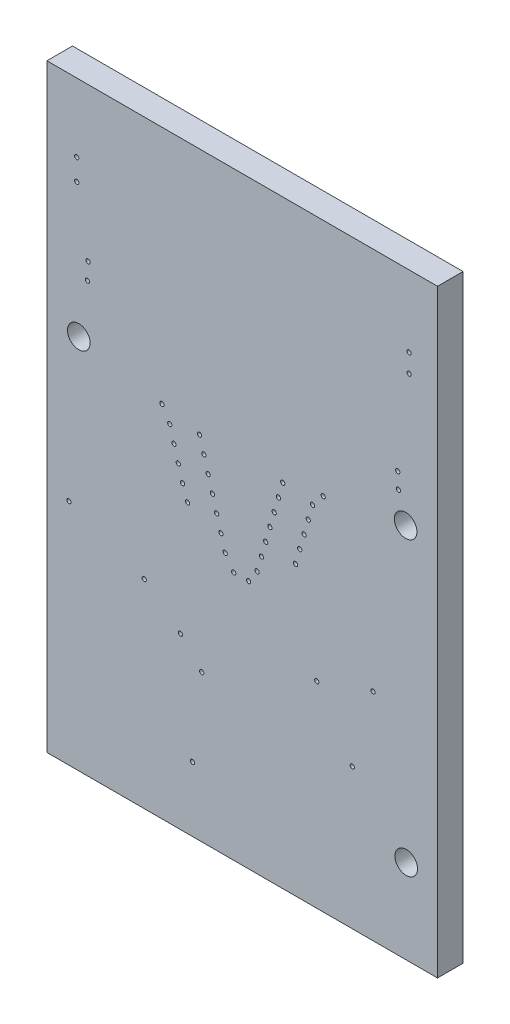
from build123d import *

# Parameters (mm, degrees)
SKETCH1_W           = 13.97
SKETCH1_H           = 21.4249
BOARD_OUTLINE_DEPTH = 0.9144
SKETCH2_R           = 0.0762
NPTH_DEPTH          = 26.593424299
SKETCH3_R           = 0.405
PTH_DEPTH           = 26.593424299


with BuildPart() as part:
    # Sketch1 → Board_Outline (new body)
    with BuildSketch(Plane.XY):
        with Locations((6.985, 10.71245)):
            Rectangle(SKETCH1_W, SKETCH1_H)
    extrude(amount=BOARD_OUTLINE_DEPTH)

    # Sketch2 → NPTH (cut, through all)
    with BuildSketch(Plane.XY):
        with Locations((11.6634, 7.7216)):
            Circle(SKETCH2_R)
        with Locations((12.954, 18.2118)):
            Circle(SKETCH2_R)
        with Locations((1.0668, 18.9738)):
            Circle(SKETCH2_R)
        with Locations((10.922, 5.0292)):
            Circle(SKETCH2_R)
        with Locations((0.7874, 8.1788)):
            Circle(SKETCH2_R)
        with Locations((5.207, 2.3114)):
            Circle(SKETCH2_R)
        with Locations((1.4732, 15.9512)):
            Circle(SKETCH2_R)
        with Locations((1.4478, 15.3416)):
            Circle(SKETCH2_R)
        with Locations((4.1148, 12.8524)):
            Circle(SKETCH2_R)
        with Locations((4.3942, 12.3698)):
            Circle(SKETCH2_R)
        with Locations((4.5466, 11.8364)):
            Circle(SKETCH2_R)
        with Locations((4.699, 11.303)):
            Circle(SKETCH2_R)
        with Locations((4.8514, 10.7696)):
            Circle(SKETCH2_R)
        with Locations((5.0292, 10.2616)):
            Circle(SKETCH2_R)
        with Locations((5.461, 12.573)):
            Circle(SKETCH2_R)
        with Locations((5.6134, 12.0396)):
            Circle(SKETCH2_R)
        with Locations((5.7658, 11.5062)):
            Circle(SKETCH2_R)
        with Locations((5.9182, 10.9728)):
            Circle(SKETCH2_R)
        with Locations((6.0706, 10.4394)):
            Circle(SKETCH2_R)
        with Locations((6.223, 9.906)):
            Circle(SKETCH2_R)
        with Locations((6.3754, 9.3726)):
            Circle(SKETCH2_R)
        with Locations((6.6802, 8.9154)):
            Circle(SKETCH2_R)
        with Locations((12.5476, 14.986)):
            Circle(SKETCH2_R)
        with Locations((12.573, 14.4272)):
            Circle(SKETCH2_R)
        with Locations((9.8806, 12.8778)):
            Circle(SKETCH2_R)
        with Locations((9.4996, 12.4206)):
            Circle(SKETCH2_R)
        with Locations((9.3472, 11.8872)):
            Circle(SKETCH2_R)
        with Locations((9.1948, 11.3538)):
            Circle(SKETCH2_R)
        with Locations((9.0424, 10.8204)):
            Circle(SKETCH2_R)
        with Locations((8.89, 10.287)):
            Circle(SKETCH2_R)
        with Locations((8.4328, 12.573)):
            Circle(SKETCH2_R)
        with Locations((8.2804, 12.0396)):
            Circle(SKETCH2_R)
        with Locations((8.128, 11.5062)):
            Circle(SKETCH2_R)
        with Locations((7.9756, 10.9728)):
            Circle(SKETCH2_R)
        with Locations((7.8232, 10.4394)):
            Circle(SKETCH2_R)
        with Locations((7.6708, 9.906)):
            Circle(SKETCH2_R)
        with Locations((7.5184, 9.3726)):
            Circle(SKETCH2_R)
        with Locations((7.2136, 8.9154)):
            Circle(SKETCH2_R)
        with Locations((12.954, 18.8722)):
            Circle(SKETCH2_R)
        with Locations((1.0668, 18.2118)):
            Circle(SKETCH2_R)
        with Locations((9.652, 7.0358)):
            Circle(SKETCH2_R)
        with Locations((3.4798, 7.112)):
            Circle(SKETCH2_R)
        with Locations((5.5372, 5.2578)):
            Circle(SKETCH2_R)
        with Locations((4.7752, 6.0706)):
            Circle(SKETCH2_R)
    extrude(amount=NPTH_DEPTH, mode=Mode.SUBTRACT)

    # Sketch3 → PTH (cut, through all)
    with BuildSketch(Plane.XY):
        with Locations((12.83, 13.45)):
            Circle(SKETCH3_R)
        with Locations((1.14, 13.45)):
            Circle(SKETCH3_R)
        with Locations((12.85, 3.02)):
            Circle(SKETCH3_R)
    extrude(amount=PTH_DEPTH, mode=Mode.SUBTRACT)


solid = part.part
